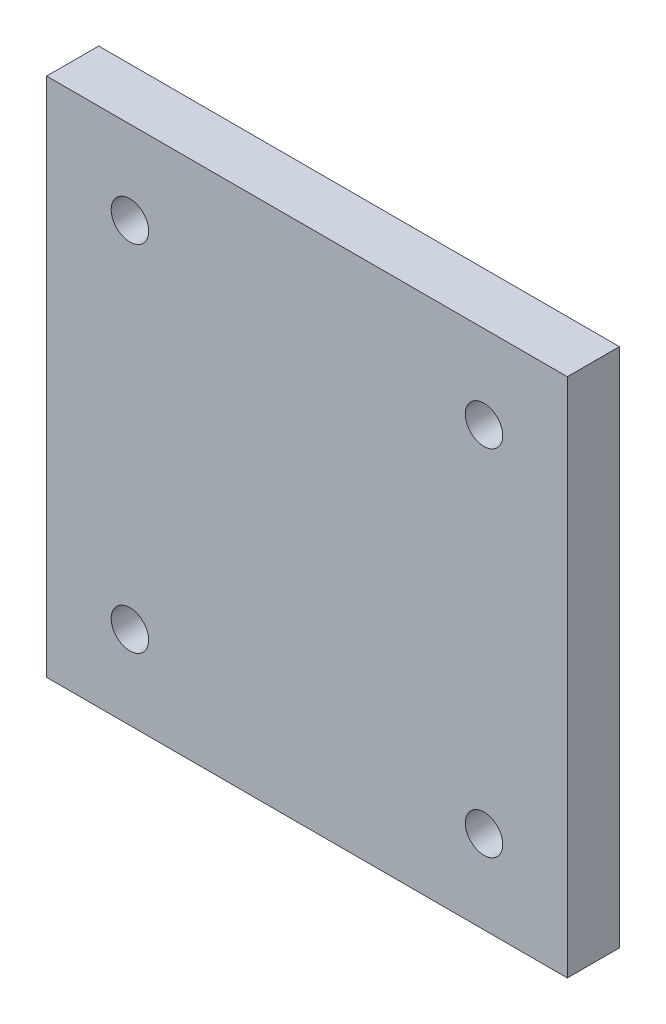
ISO-10303-21;
HEADER;
FILE_DESCRIPTION(('STEP AP214'),'2;1');
FILE_NAME('part.step','',(''),(''),'','','');
FILE_SCHEMA(('AUTOMOTIVE_DESIGN { 1 0 10303 214 1 1 1 1 }'));
ENDSEC;
DATA;
#1=APPLICATION_CONTEXT('core data for automotive mechanical design processes');
#2=APPLICATION_PROTOCOL_DEFINITION('international standard','automotive_design',2000,#1);
#3=PRODUCT_CONTEXT('',#1,'mechanical');
#4=PRODUCT('Part','Part','',(#3));
#5=PRODUCT_RELATED_PRODUCT_CATEGORY('part','',(#4));
#6=PRODUCT_DEFINITION_FORMATION('','',#4);
#7=PRODUCT_DEFINITION_CONTEXT('part definition',#1,'design');
#8=PRODUCT_DEFINITION('design','',#6,#7);
#9=PRODUCT_DEFINITION_SHAPE('','',#8);
#10=(LENGTH_UNIT() NAMED_UNIT(*) SI_UNIT(.MILLI.,.METRE.));
#11=(NAMED_UNIT(*) PLANE_ANGLE_UNIT() SI_UNIT($,.RADIAN.));
#12=(NAMED_UNIT(*) SI_UNIT($,.STERADIAN.) SOLID_ANGLE_UNIT());
#13=UNCERTAINTY_MEASURE_WITH_UNIT(LENGTH_MEASURE(1.E-05),#10,'distance_accuracy_value','');
#14=(GEOMETRIC_REPRESENTATION_CONTEXT(3) GLOBAL_UNCERTAINTY_ASSIGNED_CONTEXT((#13)) GLOBAL_UNIT_ASSIGNED_CONTEXT((#10,
#11,#12)) REPRESENTATION_CONTEXT('',''));
#15=CARTESIAN_POINT('',(0.,0.,0.));
#16=DIRECTION('',(0.,0.,1.));
#17=DIRECTION('',(1.,0.,0.));
#18=AXIS2_PLACEMENT_3D('',#15,#16,#17);
#19=CARTESIAN_POINT('',(0.,0.,25.));
#20=DIRECTION('',(0.,0.,1.));
#21=DIRECTION('',(1.,0.,0.));
#22=AXIS2_PLACEMENT_3D('',#19,#20,#21);
#23=PLANE('',#22);
#24=CARTESIAN_POINT('',(85.,85.,25.));
#25=DIRECTION('',(0.,0.,1.));
#26=DIRECTION('',(1.,0.,0.));
#27=AXIS2_PLACEMENT_3D('',#24,#25,#26);
#28=CIRCLE('',#27,9.);
#29=CARTESIAN_POINT('',(94.,85.,25.));
#30=VERTEX_POINT('',#29);
#31=EDGE_CURVE('E25',#30,#30,#28,.T.);
#32=ORIENTED_EDGE('',*,*,#31,.F.);
#33=EDGE_LOOP('',(#32));
#34=FACE_BOUND('',#33,.T.);
#35=CARTESIAN_POINT('',(85.,-85.,25.));
#36=DIRECTION('',(0.,0.,1.));
#37=DIRECTION('',(1.,0.,0.));
#38=AXIS2_PLACEMENT_3D('',#35,#36,#37);
#39=CIRCLE('',#38,9.);
#40=CARTESIAN_POINT('',(94.,-85.,25.));
#41=VERTEX_POINT('',#40);
#42=EDGE_CURVE('E108',#41,#41,#39,.T.);
#43=ORIENTED_EDGE('',*,*,#42,.F.);
#44=EDGE_LOOP('',(#43));
#45=FACE_BOUND('',#44,.T.);
#46=CARTESIAN_POINT('',(-85.,85.,25.));
#47=DIRECTION('',(0.,0.,1.));
#48=DIRECTION('',(1.,0.,0.));
#49=AXIS2_PLACEMENT_3D('',#46,#47,#48);
#50=CIRCLE('',#49,9.);
#51=CARTESIAN_POINT('',(-76.,85.,25.));
#52=VERTEX_POINT('',#51);
#53=EDGE_CURVE('E225',#52,#52,#50,.T.);
#54=ORIENTED_EDGE('',*,*,#53,.F.);
#55=EDGE_LOOP('',(#54));
#56=FACE_BOUND('',#55,.T.);
#57=CARTESIAN_POINT('',(-85.,-85.,25.));
#58=DIRECTION('',(0.,0.,1.));
#59=DIRECTION('',(1.,0.,0.));
#60=AXIS2_PLACEMENT_3D('',#57,#58,#59);
#61=CIRCLE('',#60,9.);
#62=CARTESIAN_POINT('',(-76.,-85.,25.));
#63=VERTEX_POINT('',#62);
#64=EDGE_CURVE('E242',#63,#63,#61,.T.);
#65=ORIENTED_EDGE('',*,*,#64,.F.);
#66=EDGE_LOOP('',(#65));
#67=FACE_BOUND('',#66,.T.);
#68=DIRECTION('',(1.,0.,0.));
#69=VECTOR('',#68,1.);
#70=CARTESIAN_POINT('',(-125.,-125.,25.));
#71=LINE('',#70,#69);
#72=CARTESIAN_POINT('',(-125.,-125.,25.));
#73=VERTEX_POINT('',#72);
#74=CARTESIAN_POINT('',(125.,-125.,25.));
#75=VERTEX_POINT('',#74);
#76=EDGE_CURVE('E274',#73,#75,#71,.T.);
#77=ORIENTED_EDGE('',*,*,#76,.T.);
#78=DIRECTION('',(0.,1.,0.));
#79=VECTOR('',#78,1.);
#80=CARTESIAN_POINT('',(125.,-125.,25.));
#81=LINE('',#80,#79);
#82=CARTESIAN_POINT('',(125.,125.,25.));
#83=VERTEX_POINT('',#82);
#84=EDGE_CURVE('E255',#75,#83,#81,.T.);
#85=ORIENTED_EDGE('',*,*,#84,.T.);
#86=DIRECTION('',(-1.,0.,0.));
#87=VECTOR('',#86,1.);
#88=CARTESIAN_POINT('',(125.,125.,25.));
#89=LINE('',#88,#87);
#90=CARTESIAN_POINT('',(-125.,125.,25.));
#91=VERTEX_POINT('',#90);
#92=EDGE_CURVE('E239',#83,#91,#89,.T.);
#93=ORIENTED_EDGE('',*,*,#92,.T.);
#94=DIRECTION('',(0.,-1.,0.));
#95=VECTOR('',#94,1.);
#96=CARTESIAN_POINT('',(-125.,125.,25.));
#97=LINE('',#96,#95);
#98=EDGE_CURVE('E238',#91,#73,#97,.T.);
#99=ORIENTED_EDGE('',*,*,#98,.T.);
#100=EDGE_LOOP('',(#77,#85,#93,#99));
#101=FACE_BOUND('',#100,.T.);
#102=ADVANCED_FACE('F16',(#34,#45,#56,#67,#101),#23,.T.);
#103=CARTESIAN_POINT('',(0.,0.,0.));
#104=DIRECTION('',(0.,0.,1.));
#105=DIRECTION('',(1.,0.,0.));
#106=AXIS2_PLACEMENT_3D('',#103,#104,#105);
#107=PLANE('',#106);
#108=CARTESIAN_POINT('',(85.,85.,0.));
#109=DIRECTION('',(0.,0.,1.));
#110=DIRECTION('',(1.,0.,0.));
#111=AXIS2_PLACEMENT_3D('',#108,#109,#110);
#112=CIRCLE('',#111,9.);
#113=CARTESIAN_POINT('',(94.,85.,0.));
#114=VERTEX_POINT('',#113);
#115=EDGE_CURVE('E10',#114,#114,#112,.T.);
#116=ORIENTED_EDGE('',*,*,#115,.T.);
#117=EDGE_LOOP('',(#116));
#118=FACE_BOUND('',#117,.T.);
#119=CARTESIAN_POINT('',(85.,-85.,0.));
#120=DIRECTION('',(0.,0.,1.));
#121=DIRECTION('',(1.,0.,0.));
#122=AXIS2_PLACEMENT_3D('',#119,#120,#121);
#123=CIRCLE('',#122,9.);
#124=CARTESIAN_POINT('',(94.,-85.,0.));
#125=VERTEX_POINT('',#124);
#126=EDGE_CURVE('E100',#125,#125,#123,.T.);
#127=ORIENTED_EDGE('',*,*,#126,.T.);
#128=EDGE_LOOP('',(#127));
#129=FACE_BOUND('',#128,.T.);
#130=CARTESIAN_POINT('',(-85.,85.,0.));
#131=DIRECTION('',(0.,0.,1.));
#132=DIRECTION('',(1.,0.,0.));
#133=AXIS2_PLACEMENT_3D('',#130,#131,#132);
#134=CIRCLE('',#133,9.);
#135=CARTESIAN_POINT('',(-76.,85.,0.));
#136=VERTEX_POINT('',#135);
#137=EDGE_CURVE('E222',#136,#136,#134,.T.);
#138=ORIENTED_EDGE('',*,*,#137,.T.);
#139=EDGE_LOOP('',(#138));
#140=FACE_BOUND('',#139,.T.);
#141=CARTESIAN_POINT('',(-85.,-85.,0.));
#142=DIRECTION('',(0.,0.,1.));
#143=DIRECTION('',(1.,0.,0.));
#144=AXIS2_PLACEMENT_3D('',#141,#142,#143);
#145=CIRCLE('',#144,9.);
#146=CARTESIAN_POINT('',(-76.,-85.,0.));
#147=VERTEX_POINT('',#146);
#148=EDGE_CURVE('E234',#147,#147,#145,.T.);
#149=ORIENTED_EDGE('',*,*,#148,.T.);
#150=EDGE_LOOP('',(#149));
#151=FACE_BOUND('',#150,.T.);
#152=DIRECTION('',(0.,-1.,0.));
#153=VECTOR('',#152,1.);
#154=CARTESIAN_POINT('',(-125.,125.,0.));
#155=LINE('',#154,#153);
#156=CARTESIAN_POINT('',(-125.,125.,0.));
#157=VERTEX_POINT('',#156);
#158=CARTESIAN_POINT('',(-125.,-125.,0.));
#159=VERTEX_POINT('',#158);
#160=EDGE_CURVE('E235',#157,#159,#155,.T.);
#161=ORIENTED_EDGE('',*,*,#160,.F.);
#162=DIRECTION('',(-1.,0.,0.));
#163=VECTOR('',#162,1.);
#164=CARTESIAN_POINT('',(125.,125.,0.));
#165=LINE('',#164,#163);
#166=CARTESIAN_POINT('',(125.,125.,0.));
#167=VERTEX_POINT('',#166);
#168=EDGE_CURVE('E254',#167,#157,#165,.T.);
#169=ORIENTED_EDGE('',*,*,#168,.F.);
#170=DIRECTION('',(0.,1.,0.));
#171=VECTOR('',#170,1.);
#172=CARTESIAN_POINT('',(125.,-125.,0.));
#173=LINE('',#172,#171);
#174=CARTESIAN_POINT('',(125.,-125.,0.));
#175=VERTEX_POINT('',#174);
#176=EDGE_CURVE('E263',#175,#167,#173,.T.);
#177=ORIENTED_EDGE('',*,*,#176,.F.);
#178=DIRECTION('',(1.,0.,0.));
#179=VECTOR('',#178,1.);
#180=CARTESIAN_POINT('',(-125.,-125.,0.));
#181=LINE('',#180,#179);
#182=EDGE_CURVE('E281',#159,#175,#181,.T.);
#183=ORIENTED_EDGE('',*,*,#182,.F.);
#184=EDGE_LOOP('',(#161,#169,#177,#183));
#185=FACE_BOUND('',#184,.T.);
#186=ADVANCED_FACE('F101',(#118,#129,#140,#151,#185),#107,.F.);
#187=CARTESIAN_POINT('',(85.,85.,0.));
#188=DIRECTION('',(0.,0.,-1.));
#189=DIRECTION('',(1.,0.,0.));
#190=AXIS2_PLACEMENT_3D('',#187,#188,#189);
#191=CYLINDRICAL_SURFACE('',#190,9.);
#192=DIRECTION('',(0.,0.,1.));
#193=VECTOR('',#192,1.);
#194=CARTESIAN_POINT('',(94.,85.,0.));
#195=LINE('',#194,#193);
#196=EDGE_CURVE('E107',#114,#30,#195,.T.);
#197=ORIENTED_EDGE('',*,*,#196,.T.);
#198=ORIENTED_EDGE('',*,*,#31,.T.);
#199=ORIENTED_EDGE('',*,*,#196,.F.);
#200=ORIENTED_EDGE('',*,*,#115,.F.);
#201=EDGE_LOOP('',(#197,#198,#199,#200));
#202=FACE_BOUND('',#201,.T.);
#203=ADVANCED_FACE('F18',(#202),#191,.F.);
#204=CARTESIAN_POINT('',(85.,-85.,0.));
#205=DIRECTION('',(0.,0.,-1.));
#206=DIRECTION('',(1.,0.,0.));
#207=AXIS2_PLACEMENT_3D('',#204,#205,#206);
#208=CYLINDRICAL_SURFACE('',#207,9.);
#209=DIRECTION('',(0.,0.,1.));
#210=VECTOR('',#209,1.);
#211=CARTESIAN_POINT('',(94.,-85.,0.));
#212=LINE('',#211,#210);
#213=EDGE_CURVE('E114',#125,#41,#212,.T.);
#214=ORIENTED_EDGE('',*,*,#213,.T.);
#215=ORIENTED_EDGE('',*,*,#42,.T.);
#216=ORIENTED_EDGE('',*,*,#213,.F.);
#217=ORIENTED_EDGE('',*,*,#126,.F.);
#218=EDGE_LOOP('',(#214,#215,#216,#217));
#219=FACE_BOUND('',#218,.T.);
#220=ADVANCED_FACE('F191',(#219),#208,.F.);
#221=CARTESIAN_POINT('',(-85.,85.,0.));
#222=DIRECTION('',(0.,0.,-1.));
#223=DIRECTION('',(1.,0.,0.));
#224=AXIS2_PLACEMENT_3D('',#221,#222,#223);
#225=CYLINDRICAL_SURFACE('',#224,9.);
#226=DIRECTION('',(0.,0.,1.));
#227=VECTOR('',#226,1.);
#228=CARTESIAN_POINT('',(-76.,85.,0.));
#229=LINE('',#228,#227);
#230=EDGE_CURVE('E230',#136,#52,#229,.T.);
#231=ORIENTED_EDGE('',*,*,#230,.T.);
#232=ORIENTED_EDGE('',*,*,#53,.T.);
#233=ORIENTED_EDGE('',*,*,#230,.F.);
#234=ORIENTED_EDGE('',*,*,#137,.F.);
#235=EDGE_LOOP('',(#231,#232,#233,#234));
#236=FACE_BOUND('',#235,.T.);
#237=ADVANCED_FACE('F130',(#236),#225,.F.);
#238=CARTESIAN_POINT('',(-85.,-85.,0.));
#239=DIRECTION('',(0.,0.,-1.));
#240=DIRECTION('',(1.,0.,0.));
#241=AXIS2_PLACEMENT_3D('',#238,#239,#240);
#242=CYLINDRICAL_SURFACE('',#241,9.);
#243=DIRECTION('',(0.,0.,1.));
#244=VECTOR('',#243,1.);
#245=CARTESIAN_POINT('',(-76.,-85.,0.));
#246=LINE('',#245,#244);
#247=EDGE_CURVE('E247',#147,#63,#246,.T.);
#248=ORIENTED_EDGE('',*,*,#247,.T.);
#249=ORIENTED_EDGE('',*,*,#64,.T.);
#250=ORIENTED_EDGE('',*,*,#247,.F.);
#251=ORIENTED_EDGE('',*,*,#148,.F.);
#252=EDGE_LOOP('',(#248,#249,#250,#251));
#253=FACE_BOUND('',#252,.T.);
#254=ADVANCED_FACE('F124',(#253),#242,.F.);
#255=CARTESIAN_POINT('',(-125.,125.,0.));
#256=DIRECTION('',(1.,0.,0.));
#257=DIRECTION('',(0.,1.,0.));
#258=AXIS2_PLACEMENT_3D('',#255,#256,#257);
#259=PLANE('',#258);
#260=ORIENTED_EDGE('',*,*,#160,.T.);
#261=DIRECTION('',(0.,0.,1.));
#262=VECTOR('',#261,1.);
#263=CARTESIAN_POINT('',(-125.,-125.,0.));
#264=LINE('',#263,#262);
#265=EDGE_CURVE('E267',#159,#73,#264,.T.);
#266=ORIENTED_EDGE('',*,*,#265,.T.);
#267=ORIENTED_EDGE('',*,*,#98,.F.);
#268=DIRECTION('',(0.,0.,1.));
#269=VECTOR('',#268,1.);
#270=CARTESIAN_POINT('',(-125.,125.,0.));
#271=LINE('',#270,#269);
#272=EDGE_CURVE('E246',#157,#91,#271,.T.);
#273=ORIENTED_EDGE('',*,*,#272,.F.);
#274=EDGE_LOOP('',(#260,#266,#267,#273));
#275=FACE_BOUND('',#274,.T.);
#276=ADVANCED_FACE('F129',(#275),#259,.F.);
#277=CARTESIAN_POINT('',(125.,125.,0.));
#278=DIRECTION('',(0.,-1.,0.));
#279=DIRECTION('',(0.,0.,-1.));
#280=AXIS2_PLACEMENT_3D('',#277,#278,#279);
#281=PLANE('',#280);
#282=ORIENTED_EDGE('',*,*,#168,.T.);
#283=ORIENTED_EDGE('',*,*,#272,.T.);
#284=ORIENTED_EDGE('',*,*,#92,.F.);
#285=DIRECTION('',(0.,0.,1.));
#286=VECTOR('',#285,1.);
#287=CARTESIAN_POINT('',(125.,125.,0.));
#288=LINE('',#287,#286);
#289=EDGE_CURVE('E259',#167,#83,#288,.T.);
#290=ORIENTED_EDGE('',*,*,#289,.F.);
#291=EDGE_LOOP('',(#282,#283,#284,#290));
#292=FACE_BOUND('',#291,.T.);
#293=ADVANCED_FACE('F152',(#292),#281,.F.);
#294=CARTESIAN_POINT('',(125.,-125.,0.));
#295=DIRECTION('',(-1.,0.,0.));
#296=DIRECTION('',(0.,0.,1.));
#297=AXIS2_PLACEMENT_3D('',#294,#295,#296);
#298=PLANE('',#297);
#299=ORIENTED_EDGE('',*,*,#176,.T.);
#300=ORIENTED_EDGE('',*,*,#289,.T.);
#301=ORIENTED_EDGE('',*,*,#84,.F.);
#302=DIRECTION('',(0.,0.,1.));
#303=VECTOR('',#302,1.);
#304=CARTESIAN_POINT('',(125.,-125.,0.));
#305=LINE('',#304,#303);
#306=EDGE_CURVE('E280',#175,#75,#305,.T.);
#307=ORIENTED_EDGE('',*,*,#306,.F.);
#308=EDGE_LOOP('',(#299,#300,#301,#307));
#309=FACE_BOUND('',#308,.T.);
#310=ADVANCED_FACE('F143',(#309),#298,.F.);
#311=CARTESIAN_POINT('',(-125.,-125.,0.));
#312=DIRECTION('',(0.,1.,0.));
#313=DIRECTION('',(1.,0.,0.));
#314=AXIS2_PLACEMENT_3D('',#311,#312,#313);
#315=PLANE('',#314);
#316=ORIENTED_EDGE('',*,*,#182,.T.);
#317=ORIENTED_EDGE('',*,*,#306,.T.);
#318=ORIENTED_EDGE('',*,*,#76,.F.);
#319=ORIENTED_EDGE('',*,*,#265,.F.);
#320=EDGE_LOOP('',(#316,#317,#318,#319));
#321=FACE_BOUND('',#320,.T.);
#322=ADVANCED_FACE('F138',(#321),#315,.F.);
#323=CLOSED_SHELL('',(#102,#186,#203,#220,#237,#254,#276,#293,#310,#322));
#324=MANIFOLD_SOLID_BREP('B1',#323);
#325=ADVANCED_BREP_SHAPE_REPRESENTATION('',(#18,#324),#14);
#326=SHAPE_DEFINITION_REPRESENTATION(#9,#325);
ENDSEC;
END-ISO-10303-21;
